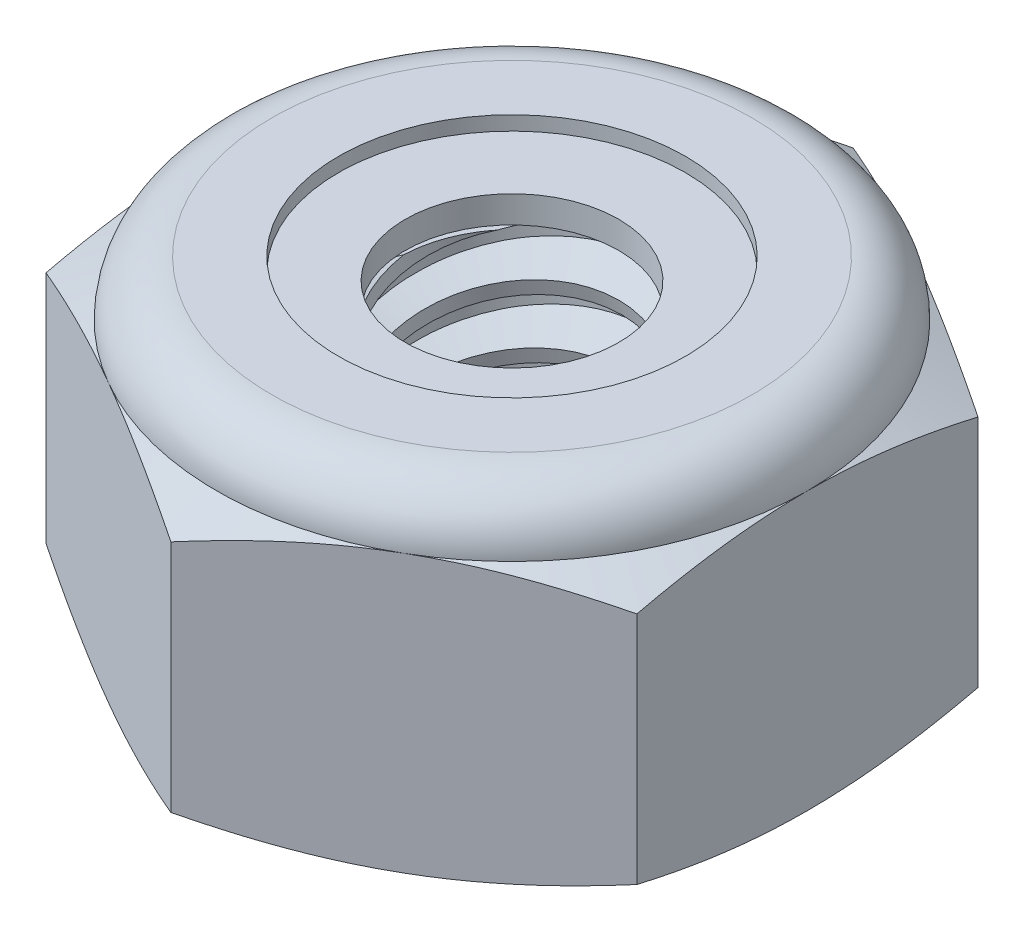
from build123d import *

# Parameters (mm, degrees)
EXTRUDE1_DEPTH      = 3.571875
SKETCH2_W           = 1.4224
SKETCH2_H           = 3.571875
LPATTERN1_COUNT     = 6
LPATTERN1_PITCH     = 0.635
LPATTERN1_COL_COUNT = 2
LPATTERN1_COL_PITCH = 0.635


with BuildPart() as part:
    # Sketch1 → Extrude1 (new body)
    with BuildSketch(Plane(origin=(0, 0, 0), x_dir=(1, 0, 0), z_dir=(0, 1, 0))):
        Polygon((0, 3.666174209), (-3.175, 1.833087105), (-3.175, -1.833087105), (0, -3.666174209), (3.175, -1.833087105), (3.175, 1.833087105), align=None)
    extrude(amount=EXTRUDE1_DEPTH)

    # Sketch4 → Cut-Revolve2 (revolve, cut)
    with BuildSketch(Plane(origin=(0, 0, 0), x_dir=(0, 0, -1), z_dir=(1, 0, 0))):
        Polygon((0, 3.571875), (1.4224, 3.571875), (1.147473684, 3.443674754), (1.147473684, 0.128200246), (1.4224, 0), (0, 0), align=None)
    revolve(axis=Axis((0, 3.571875, 0), (0, 1, 0)), mode=Mode.SUBTRACT)


with BuildPart() as body_2:
    # Sketch2 → Revolve1 (revolve)
    with BuildSketch(Plane(origin=(0, 0, 0), x_dir=(0, 0, -1), z_dir=(1, 0, 0))):
        with Locations((0.7112, 1.7859375)):
            Rectangle(SKETCH2_W, SKETCH2_H)
    revolve(axis=Axis((0, -1.4224, 0), (0, 1, 0)))

    # Sketch3 → Cut-Revolve1 (revolve, cut)
    with BuildSketch(Plane(origin=(0, 0, 0), x_dir=(0, 0, -1), z_dir=(1, 0, 0)), mode=Mode.PRIVATE) as cut_revolve1_sk:
        Polygon((1.439692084, 3.494406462), (1.560736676, 2.952126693), (1.182057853, 3.070921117), (1.147473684, 3.225858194), align=None)
    cut_revolve1 = revolve(cut_revolve1_sk.sketch.rotate(Axis((0, 3.571875, 0.152561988), (0, -0.9759815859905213, -0.21785303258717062)), 180), axis=Axis((0, 3.571875, 0.152561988), (0, -0.9759815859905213, -0.21785303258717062)), mode=Mode.SUBTRACT)

    # LPattern1: Cut-Revolve1 ×6
    with Locations(*[(0, -i * LPATTERN1_PITCH, 0) for i in range(1, LPATTERN1_COUNT)]):
        add(cut_revolve1, mode=Mode.SUBTRACT)

    # LPattern1 col: Cut-Revolve1 ×2
    with Locations(*[(0, i * LPATTERN1_COL_PITCH, 0) for i in range(1, LPATTERN1_COL_COUNT)]):
        add(cut_revolve1, mode=Mode.SUBTRACT)


with BuildPart() as part_1:
    add(part.part)

    # Combine1: cut body 2
    add(body_2.part, mode=Mode.SUBTRACT)

    # Sketch5 → Cut-Revolve3 (revolve, cut)
    with BuildSketch(Plane(origin=(0, 0, 0), x_dir=(0, 0, -1), z_dir=(1, 0, 0)), mode=Mode.PRIVATE) as cut_revolve3_sk:
        with BuildLine():
            Line((0, 0), (3.175, 0))
            Line((3.175, 0), (3.666174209, 0.229038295))
            Line((3.666174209, 0.229038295), (3.666174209, 2.747524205))
            Line((3.666174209, 2.747524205), (3.175, 2.9765625))
            ThreePointArc((3.175, 2.9765625), (3.000637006, 3.397512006), (2.5796875, 3.571875))
            Line((2.5796875, 3.571875), (2.5796875, 4.841875))
            Line((2.5796875, 4.841875), (4.936174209, 4.841875))
            Line((4.936174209, 4.841875), (4.936174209, -1.27))
            Line((4.936174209, -1.27), (0, -1.27))
            Line((0, -1.27), (0, 0))
        make_face()
    revolve(cut_revolve3_sk.sketch.rotate(Axis((0, 0, 0), (0, 1, 0)), 47.880307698), axis=Axis((0, 0, 0), (0, 1, 0)), mode=Mode.SUBTRACT)

    # Sketch6 → Cut-Revolve4 (revolve, cut)
    with BuildSketch(Plane(origin=(0, 0, 0), x_dir=(0, 0, -1), z_dir=(1, 0, 0)), mode=Mode.PRIVATE) as cut_revolve4_sk:
        with BuildLine():
            Line((0, 2.9765625), (3.0226, 2.9765625))
            ThreePointArc((3.0226, 2.9765625), (2.892873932, 3.289748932), (2.5796875, 3.419475))
            Line((2.5796875, 3.419475), (1.863580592, 3.419475))
            Line((1.863580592, 3.419475), (1.863580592, 4.841875))
            Line((1.863580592, 4.841875), (0, 4.841875))
            Line((0, 4.841875), (0, 2.9765625))
        make_face()
    revolve(cut_revolve4_sk.sketch.rotate(Axis((0, 4.841875, 0), (0, 1, 0)), 20.277821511), axis=Axis((0, 4.841875, 0), (0, 1, 0)), mode=Mode.SUBTRACT)


with BuildPart() as body_2_2:
    # Sketch7 → Revolve2 (revolve)
    with BuildSketch(Plane(origin=(0, 0, 0), x_dir=(0, 0, -1), z_dir=(1, 0, 0))):
        with BuildLine():
            Line((1.147473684, 3.0527625), (2.938395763, 3.0527625))
            ThreePointArc((2.938395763, 3.0527625), (2.810484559, 3.261537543), (2.5796875, 3.343275))
            Line((2.5796875, 3.343275), (1.147473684, 3.343275))
            Line((1.147473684, 3.343275), (1.147473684, 3.0527625))
        make_face()
    revolve(axis=Axis((0, 3.0527625, 0), (0, 1, 0)))


solid = Compound([part_1.part, body_2_2.part])
